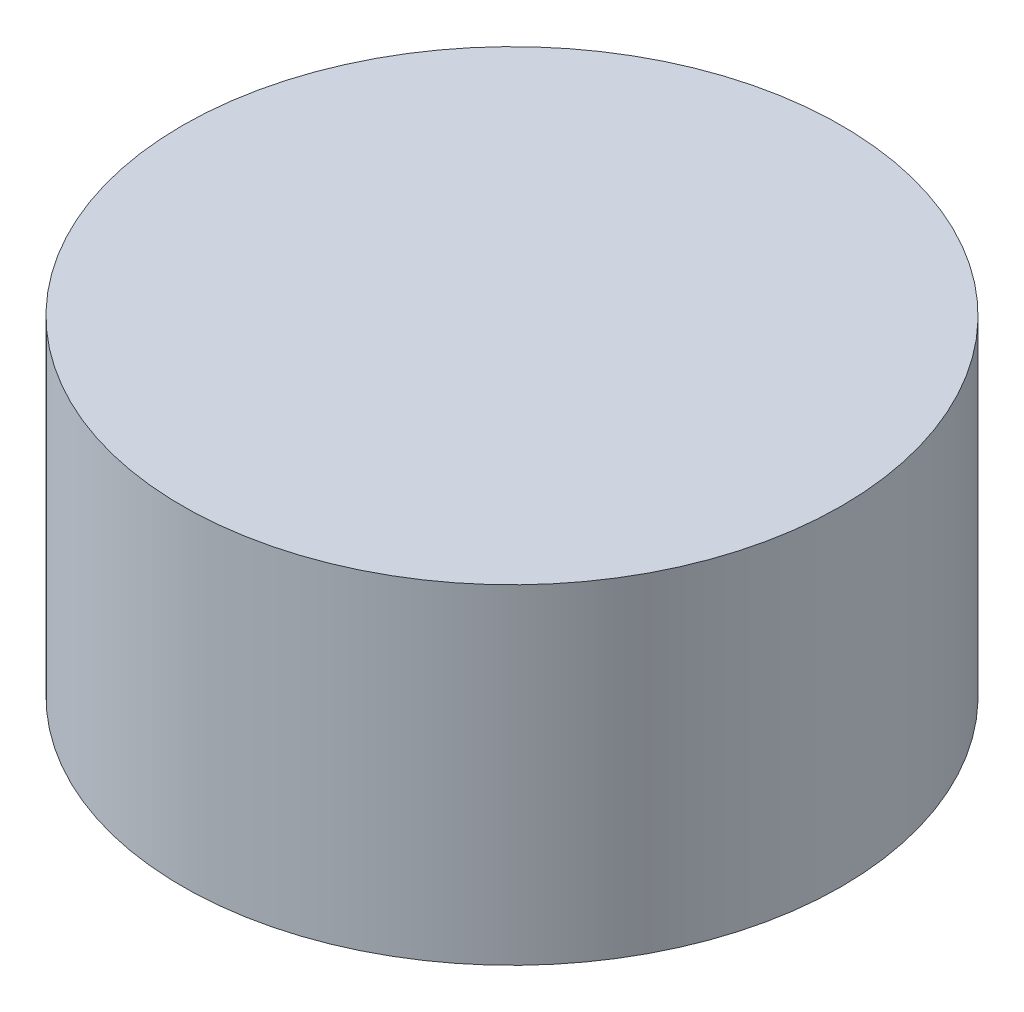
ISO-10303-21;
HEADER;
FILE_DESCRIPTION(('STEP AP214'),'2;1');
FILE_NAME('part.step','',(''),(''),'','','');
FILE_SCHEMA(('AUTOMOTIVE_DESIGN { 1 0 10303 214 1 1 1 1 }'));
ENDSEC;
DATA;
#1=APPLICATION_CONTEXT('core data for automotive mechanical design processes');
#2=APPLICATION_PROTOCOL_DEFINITION('international standard','automotive_design',2000,#1);
#3=PRODUCT_CONTEXT('',#1,'mechanical');
#4=PRODUCT('Part','Part','',(#3));
#5=PRODUCT_RELATED_PRODUCT_CATEGORY('part','',(#4));
#6=PRODUCT_DEFINITION_FORMATION('','',#4);
#7=PRODUCT_DEFINITION_CONTEXT('part definition',#1,'design');
#8=PRODUCT_DEFINITION('design','',#6,#7);
#9=PRODUCT_DEFINITION_SHAPE('','',#8);
#10=(LENGTH_UNIT() NAMED_UNIT(*) SI_UNIT(.MILLI.,.METRE.));
#11=(NAMED_UNIT(*) PLANE_ANGLE_UNIT() SI_UNIT($,.RADIAN.));
#12=(NAMED_UNIT(*) SI_UNIT($,.STERADIAN.) SOLID_ANGLE_UNIT());
#13=UNCERTAINTY_MEASURE_WITH_UNIT(LENGTH_MEASURE(1.E-05),#10,'distance_accuracy_value','');
#14=(GEOMETRIC_REPRESENTATION_CONTEXT(3) GLOBAL_UNCERTAINTY_ASSIGNED_CONTEXT((#13)) GLOBAL_UNIT_ASSIGNED_CONTEXT((#10,
#11,#12)) REPRESENTATION_CONTEXT('',''));
#15=CARTESIAN_POINT('',(0.,0.,0.));
#16=DIRECTION('',(0.,0.,1.));
#17=DIRECTION('',(1.,0.,0.));
#18=AXIS2_PLACEMENT_3D('',#15,#16,#17);
#19=CARTESIAN_POINT('',(0.,-15.,20.));
#20=DIRECTION('',(0.514495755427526,0.857492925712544,0.));
#21=DIRECTION('',(-0.857492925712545,0.514495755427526,0.));
#22=AXIS2_PLACEMENT_3D('',#19,#20,#21);
#23=PLANE('',#22);
#24=DIRECTION('',(0.857492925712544,-0.514495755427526,0.));
#25=VECTOR('',#24,1.);
#26=CARTESIAN_POINT('',(0.,-15.,-20.));
#27=LINE('',#26,#25);
#28=CARTESIAN_POINT('',(-25.,0.,-20.));
#29=VERTEX_POINT('',#28);
#30=CARTESIAN_POINT('',(-2.58377770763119,-13.4497333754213,-20.));
#31=VERTEX_POINT('',#30);
#32=EDGE_CURVE('E230',#29,#31,#27,.T.);
#33=ORIENTED_EDGE('',*,*,#32,.T.);
#34=DIRECTION('',(0.,0.,-1.));
#35=VECTOR('',#34,1.);
#36=CARTESIAN_POINT('',(-2.58377770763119,-13.4497333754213,20.));
#37=LINE('',#36,#35);
#38=CARTESIAN_POINT('',(-2.58377770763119,-13.4497333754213,-10.));
#39=VERTEX_POINT('',#38);
#40=EDGE_CURVE('E54',#31,#39,#37,.F.);
#41=ORIENTED_EDGE('',*,*,#40,.T.);
#42=DIRECTION('',(0.857492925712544,-0.514495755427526,0.));
#43=VECTOR('',#42,1.);
#44=CARTESIAN_POINT('',(0.,-15.,-10.));
#45=LINE('',#44,#43);
#46=CARTESIAN_POINT('',(-25.,0.,-10.));
#47=VERTEX_POINT('',#46);
#48=EDGE_CURVE('E272',#47,#39,#45,.T.);
#49=ORIENTED_EDGE('',*,*,#48,.F.);
#50=DIRECTION('',(0.,0.,-1.));
#51=VECTOR('',#50,1.);
#52=CARTESIAN_POINT('',(-25.,0.,20.));
#53=LINE('',#52,#51);
#54=EDGE_CURVE('E138',#47,#29,#53,.T.);
#55=ORIENTED_EDGE('',*,*,#54,.T.);
#56=EDGE_LOOP('',(#33,#41,#49,#55));
#57=FACE_BOUND('',#56,.T.);
#58=ADVANCED_FACE('F45',(#57),#23,.F.);
#59=CARTESIAN_POINT('',(0.,-15.,20.));
#60=DIRECTION('',(-0.517811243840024,0.855494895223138,0.));
#61=DIRECTION('',(-0.855494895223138,-0.517811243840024,0.));
#62=AXIS2_PLACEMENT_3D('',#59,#60,#61);
#63=PLANE('',#62);
#64=DIRECTION('',(0.855494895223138,0.517811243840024,0.));
#65=VECTOR('',#64,1.);
#66=CARTESIAN_POINT('',(0.,-15.,-10.));
#67=LINE('',#66,#65);
#68=CARTESIAN_POINT('',(2.57775728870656,-13.4397432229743,-10.));
#69=VERTEX_POINT('',#68);
#70=CARTESIAN_POINT('',(24.7820486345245,0.,-10.));
#71=VERTEX_POINT('',#70);
#72=EDGE_CURVE('E275',#69,#71,#67,.T.);
#73=ORIENTED_EDGE('',*,*,#72,.F.);
#74=DIRECTION('',(0.,0.,-1.));
#75=VECTOR('',#74,1.);
#76=CARTESIAN_POINT('',(2.57775728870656,-13.4397432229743,20.));
#77=LINE('',#76,#75);
#78=CARTESIAN_POINT('',(2.57775728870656,-13.4397432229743,-20.));
#79=VERTEX_POINT('',#78);
#80=EDGE_CURVE('E213',#69,#79,#77,.T.);
#81=ORIENTED_EDGE('',*,*,#80,.T.);
#82=DIRECTION('',(0.855494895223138,0.517811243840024,0.));
#83=VECTOR('',#82,1.);
#84=CARTESIAN_POINT('',(0.,-15.,-20.));
#85=LINE('',#84,#83);
#86=CARTESIAN_POINT('',(24.7820486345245,0.,-20.));
#87=VERTEX_POINT('',#86);
#88=EDGE_CURVE('E229',#79,#87,#85,.T.);
#89=ORIENTED_EDGE('',*,*,#88,.T.);
#90=DIRECTION('',(0.,0.,-1.));
#91=VECTOR('',#90,1.);
#92=CARTESIAN_POINT('',(24.7820486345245,0.,0.));
#93=LINE('',#92,#91);
#94=EDGE_CURVE('E186',#71,#87,#93,.T.);
#95=ORIENTED_EDGE('',*,*,#94,.F.);
#96=EDGE_LOOP('',(#73,#81,#89,#95));
#97=FACE_BOUND('',#96,.T.);
#98=ADVANCED_FACE('F297',(#97),#63,.F.);
#99=CARTESIAN_POINT('',(0.,50.,0.));
#100=DIRECTION('',(0.,1.,0.));
#101=DIRECTION('',(-1.,0.,0.));
#102=AXIS2_PLACEMENT_3D('',#99,#100,#101);
#103=PLANE('',#102);
#104=CARTESIAN_POINT('',(0.,50.,0.));
#105=DIRECTION('',(0.,-1.,0.));
#106=DIRECTION('',(1.,0.,0.));
#107=AXIS2_PLACEMENT_3D('',#104,#105,#106);
#108=CIRCLE('',#107,50.);
#109=CARTESIAN_POINT('',(50.,50.,0.));
#110=VERTEX_POINT('',#109);
#111=EDGE_CURVE('E177',#110,#110,#108,.T.);
#112=ORIENTED_EDGE('',*,*,#111,.F.);
#113=EDGE_LOOP('',(#112));
#114=FACE_BOUND('',#113,.T.);
#115=ADVANCED_FACE('F303',(#114),#103,.T.);
#116=CARTESIAN_POINT('',(0.,0.,0.));
#117=DIRECTION('',(0.,-1.,0.));
#118=DIRECTION('',(1.,0.,0.));
#119=AXIS2_PLACEMENT_3D('',#116,#117,#118);
#120=CYLINDRICAL_SURFACE('',#119,50.);
#121=ORIENTED_EDGE('',*,*,#111,.T.);
#122=EDGE_LOOP('',(#121));
#123=FACE_BOUND('',#122,.T.);
#124=CARTESIAN_POINT('',(0.,0.,0.));
#125=DIRECTION('',(0.,-1.,0.));
#126=DIRECTION('',(1.,0.,0.));
#127=AXIS2_PLACEMENT_3D('',#124,#125,#126);
#128=CIRCLE('',#127,50.);
#129=CARTESIAN_POINT('',(50.,0.,0.));
#130=VERTEX_POINT('',#129);
#131=EDGE_CURVE('E172',#130,#130,#128,.T.);
#132=ORIENTED_EDGE('',*,*,#131,.F.);
#133=EDGE_LOOP('',(#132));
#134=FACE_BOUND('',#133,.T.);
#135=ADVANCED_FACE('F312',(#123,#134),#120,.T.);
#136=CARTESIAN_POINT('',(0.,0.,0.));
#137=DIRECTION('',(0.,-1.,0.));
#138=DIRECTION('',(1.,0.,0.));
#139=AXIS2_PLACEMENT_3D('',#136,#137,#138);
#140=PLANE('',#139);
#141=CARTESIAN_POINT('',(24.7820486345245,0.,20.));
#142=VERTEX_POINT('',#141);
#143=CARTESIAN_POINT('',(24.7820486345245,0.,10.));
#144=VERTEX_POINT('',#143);
#145=EDGE_CURVE('E187',#142,#144,#93,.T.);
#146=ORIENTED_EDGE('',*,*,#145,.T.);
#147=EDGE_CURVE('E191',#144,#71,#93,.T.);
#148=ORIENTED_EDGE('',*,*,#147,.T.);
#149=ORIENTED_EDGE('',*,*,#94,.T.);
#150=DIRECTION('',(-1.,0.,0.));
#151=VECTOR('',#150,1.);
#152=CARTESIAN_POINT('',(0.,0.,-20.));
#153=LINE('',#152,#151);
#154=EDGE_CURVE('E194',#87,#29,#153,.T.);
#155=ORIENTED_EDGE('',*,*,#154,.T.);
#156=ORIENTED_EDGE('',*,*,#54,.F.);
#157=DIRECTION('',(0.,0.,1.));
#158=VECTOR('',#157,1.);
#159=CARTESIAN_POINT('',(-25.,0.,-10.));
#160=LINE('',#159,#158);
#161=CARTESIAN_POINT('',(-25.,0.,10.));
#162=VERTEX_POINT('',#161);
#163=EDGE_CURVE('E129',#47,#162,#160,.T.);
#164=ORIENTED_EDGE('',*,*,#163,.T.);
#165=CARTESIAN_POINT('',(-25.,0.,20.));
#166=VERTEX_POINT('',#165);
#167=EDGE_CURVE('E136',#166,#162,#53,.T.);
#168=ORIENTED_EDGE('',*,*,#167,.F.);
#169=DIRECTION('',(-1.,0.,0.));
#170=VECTOR('',#169,1.);
#171=CARTESIAN_POINT('',(0.,0.,20.));
#172=LINE('',#171,#170);
#173=EDGE_CURVE('E190',#142,#166,#172,.T.);
#174=ORIENTED_EDGE('',*,*,#173,.F.);
#175=EDGE_LOOP('',(#146,#148,#149,#155,#156,#164,#168,#174));
#176=FACE_BOUND('',#175,.T.);
#177=ORIENTED_EDGE('',*,*,#131,.T.);
#178=EDGE_LOOP('',(#177));
#179=FACE_BOUND('',#178,.T.);
#180=ADVANCED_FACE('F132',(#176,#179),#140,.T.);
#181=DIRECTION('',(0.857492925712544,-0.514495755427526,0.));
#182=VECTOR('',#181,1.);
#183=CARTESIAN_POINT('',(0.,-15.,10.));
#184=LINE('',#183,#182);
#185=CARTESIAN_POINT('',(-2.58377770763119,-13.4497333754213,10.));
#186=VERTEX_POINT('',#185);
#187=EDGE_CURVE('E150',#162,#186,#184,.T.);
#188=ORIENTED_EDGE('',*,*,#187,.T.);
#189=DIRECTION('',(0.,0.,-1.));
#190=VECTOR('',#189,1.);
#191=CARTESIAN_POINT('',(-2.58377770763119,-13.4497333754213,20.));
#192=LINE('',#191,#190);
#193=CARTESIAN_POINT('',(-2.58377770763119,-13.4497333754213,20.));
#194=VERTEX_POINT('',#193);
#195=EDGE_CURVE('E207',#186,#194,#192,.F.);
#196=ORIENTED_EDGE('',*,*,#195,.T.);
#197=DIRECTION('',(0.857492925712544,-0.514495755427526,0.));
#198=VECTOR('',#197,1.);
#199=CARTESIAN_POINT('',(0.,-15.,20.));
#200=LINE('',#199,#198);
#201=EDGE_CURVE('E170',#166,#194,#200,.T.);
#202=ORIENTED_EDGE('',*,*,#201,.F.);
#203=ORIENTED_EDGE('',*,*,#167,.T.);
#204=EDGE_LOOP('',(#188,#196,#202,#203));
#205=FACE_BOUND('',#204,.T.);
#206=ADVANCED_FACE('F168',(#205),#23,.F.);
#207=DIRECTION('',(0.855494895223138,0.517811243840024,0.));
#208=VECTOR('',#207,1.);
#209=CARTESIAN_POINT('',(0.,-15.,20.));
#210=LINE('',#209,#208);
#211=CARTESIAN_POINT('',(2.57775728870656,-13.4397432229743,20.));
#212=VERTEX_POINT('',#211);
#213=EDGE_CURVE('E179',#212,#142,#210,.T.);
#214=ORIENTED_EDGE('',*,*,#213,.F.);
#215=DIRECTION('',(0.,0.,-1.));
#216=VECTOR('',#215,1.);
#217=CARTESIAN_POINT('',(2.57775728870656,-13.4397432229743,20.));
#218=LINE('',#217,#216);
#219=CARTESIAN_POINT('',(2.57775728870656,-13.4397432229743,10.));
#220=VERTEX_POINT('',#219);
#221=EDGE_CURVE('E201',#212,#220,#218,.T.);
#222=ORIENTED_EDGE('',*,*,#221,.T.);
#223=DIRECTION('',(0.855494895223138,0.517811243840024,0.));
#224=VECTOR('',#223,1.);
#225=CARTESIAN_POINT('',(0.,-15.,10.));
#226=LINE('',#225,#224);
#227=EDGE_CURVE('E249',#220,#144,#226,.T.);
#228=ORIENTED_EDGE('',*,*,#227,.T.);
#229=ORIENTED_EDGE('',*,*,#145,.F.);
#230=EDGE_LOOP('',(#214,#222,#228,#229));
#231=FACE_BOUND('',#230,.T.);
#232=ADVANCED_FACE('F248',(#231),#63,.F.);
#233=CARTESIAN_POINT('',(0.,0.,20.));
#234=DIRECTION('',(0.,0.,1.));
#235=DIRECTION('',(1.,0.,0.));
#236=AXIS2_PLACEMENT_3D('',#233,#234,#235);
#237=PLANE('',#236);
#238=ORIENTED_EDGE('',*,*,#201,.T.);
#239=CARTESIAN_POINT('',(-0.011298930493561,-9.16226874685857,20.));
#240=DIRECTION('',(0.,0.,1.));
#241=DIRECTION('',(1.,0.,0.));
#242=AXIS2_PLACEMENT_3D('',#239,#240,#241);
#243=CIRCLE('',#242,5.);
#244=EDGE_CURVE('E210',#194,#212,#243,.T.);
#245=ORIENTED_EDGE('',*,*,#244,.T.);
#246=ORIENTED_EDGE('',*,*,#213,.T.);
#247=ORIENTED_EDGE('',*,*,#173,.T.);
#248=EDGE_LOOP('',(#238,#245,#246,#247));
#249=FACE_BOUND('',#248,.T.);
#250=ADVANCED_FACE('F245',(#249),#237,.T.);
#251=CARTESIAN_POINT('',(0.,0.,-20.));
#252=DIRECTION('',(0.,0.,1.));
#253=DIRECTION('',(1.,0.,0.));
#254=AXIS2_PLACEMENT_3D('',#251,#252,#253);
#255=PLANE('',#254);
#256=ORIENTED_EDGE('',*,*,#88,.F.);
#257=CARTESIAN_POINT('',(-0.011298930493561,-9.16226874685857,-20.));
#258=DIRECTION('',(0.,0.,1.));
#259=DIRECTION('',(1.,0.,0.));
#260=AXIS2_PLACEMENT_3D('',#257,#258,#259);
#261=CIRCLE('',#260,5.);
#262=EDGE_CURVE('E68',#79,#31,#261,.F.);
#263=ORIENTED_EDGE('',*,*,#262,.T.);
#264=ORIENTED_EDGE('',*,*,#32,.F.);
#265=ORIENTED_EDGE('',*,*,#154,.F.);
#266=EDGE_LOOP('',(#256,#263,#264,#265));
#267=FACE_BOUND('',#266,.T.);
#268=ADVANCED_FACE('F228',(#267),#255,.F.);
#269=CARTESIAN_POINT('',(-25.,15.1319209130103,-10.));
#270=DIRECTION('',(-1.,0.,0.));
#271=DIRECTION('',(0.,-1.,0.));
#272=AXIS2_PLACEMENT_3D('',#269,#270,#271);
#273=PLANE('',#272);
#274=DIRECTION('',(0.,0.,1.));
#275=VECTOR('',#274,1.);
#276=CARTESIAN_POINT('',(-25.,15.1319209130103,-10.));
#277=LINE('',#276,#275);
#278=CARTESIAN_POINT('',(-25.,15.1319209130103,-10.));
#279=VERTEX_POINT('',#278);
#280=CARTESIAN_POINT('',(-25.,15.1319209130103,10.));
#281=VERTEX_POINT('',#280);
#282=EDGE_CURVE('E162',#279,#281,#277,.T.);
#283=ORIENTED_EDGE('',*,*,#282,.T.);
#284=DIRECTION('',(0.,-1.,0.));
#285=VECTOR('',#284,1.);
#286=CARTESIAN_POINT('',(-25.,15.1319209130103,10.));
#287=LINE('',#286,#285);
#288=EDGE_CURVE('E154',#281,#162,#287,.T.);
#289=ORIENTED_EDGE('',*,*,#288,.T.);
#290=ORIENTED_EDGE('',*,*,#163,.F.);
#291=DIRECTION('',(0.,-1.,0.));
#292=VECTOR('',#291,1.);
#293=CARTESIAN_POINT('',(-25.,15.1319209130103,-10.));
#294=LINE('',#293,#292);
#295=EDGE_CURVE('E269',#279,#47,#294,.T.);
#296=ORIENTED_EDGE('',*,*,#295,.F.);
#297=EDGE_LOOP('',(#283,#289,#290,#296));
#298=FACE_BOUND('',#297,.T.);
#299=ADVANCED_FACE('F161',(#298),#273,.F.);
#300=CARTESIAN_POINT('',(-25.,15.1319209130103,-10.));
#301=DIRECTION('',(0.,1.,0.));
#302=DIRECTION('',(-1.,0.,0.));
#303=AXIS2_PLACEMENT_3D('',#300,#301,#302);
#304=PLANE('',#303);
#305=DIRECTION('',(0.,0.,1.));
#306=VECTOR('',#305,1.);
#307=CARTESIAN_POINT('',(25.,15.1319209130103,-10.));
#308=LINE('',#307,#306);
#309=CARTESIAN_POINT('',(25.,15.1319209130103,-10.));
#310=VERTEX_POINT('',#309);
#311=CARTESIAN_POINT('',(25.,15.1319209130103,10.));
#312=VERTEX_POINT('',#311);
#313=EDGE_CURVE('E236',#310,#312,#308,.T.);
#314=ORIENTED_EDGE('',*,*,#313,.T.);
#315=DIRECTION('',(-1.,0.,0.));
#316=VECTOR('',#315,1.);
#317=CARTESIAN_POINT('',(-25.,15.1319209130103,10.));
#318=LINE('',#317,#316);
#319=EDGE_CURVE('E266',#312,#281,#318,.T.);
#320=ORIENTED_EDGE('',*,*,#319,.T.);
#321=ORIENTED_EDGE('',*,*,#282,.F.);
#322=DIRECTION('',(-1.,0.,0.));
#323=VECTOR('',#322,1.);
#324=CARTESIAN_POINT('',(-25.,15.1319209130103,-10.));
#325=LINE('',#324,#323);
#326=EDGE_CURVE('E145',#310,#279,#325,.T.);
#327=ORIENTED_EDGE('',*,*,#326,.F.);
#328=EDGE_LOOP('',(#314,#320,#321,#327));
#329=FACE_BOUND('',#328,.T.);
#330=ADVANCED_FACE('F294',(#329),#304,.F.);
#331=CARTESIAN_POINT('',(25.,15.1319209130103,-10.));
#332=DIRECTION('',(1.,0.,0.));
#333=DIRECTION('',(0.,0.,-1.));
#334=AXIS2_PLACEMENT_3D('',#331,#332,#333);
#335=PLANE('',#334);
#336=DIRECTION('',(0.,0.,1.));
#337=VECTOR('',#336,1.);
#338=CARTESIAN_POINT('',(25.,0.131920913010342,-10.));
#339=LINE('',#338,#337);
#340=CARTESIAN_POINT('',(25.,0.131920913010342,-10.));
#341=VERTEX_POINT('',#340);
#342=CARTESIAN_POINT('',(25.,0.131920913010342,10.));
#343=VERTEX_POINT('',#342);
#344=EDGE_CURVE('E144',#341,#343,#339,.T.);
#345=ORIENTED_EDGE('',*,*,#344,.T.);
#346=DIRECTION('',(0.,1.,0.));
#347=VECTOR('',#346,1.);
#348=CARTESIAN_POINT('',(25.,15.1319209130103,10.));
#349=LINE('',#348,#347);
#350=EDGE_CURVE('E252',#343,#312,#349,.T.);
#351=ORIENTED_EDGE('',*,*,#350,.T.);
#352=ORIENTED_EDGE('',*,*,#313,.F.);
#353=DIRECTION('',(0.,1.,0.));
#354=VECTOR('',#353,1.);
#355=CARTESIAN_POINT('',(25.,15.1319209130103,-10.));
#356=LINE('',#355,#354);
#357=EDGE_CURVE('E278',#341,#310,#356,.T.);
#358=ORIENTED_EDGE('',*,*,#357,.F.);
#359=EDGE_LOOP('',(#345,#351,#352,#358));
#360=FACE_BOUND('',#359,.T.);
#361=ADVANCED_FACE('F289',(#360),#335,.F.);
#362=CARTESIAN_POINT('',(0.,-15.,-10.));
#363=DIRECTION('',(0.517811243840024,-0.855494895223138,0.));
#364=DIRECTION('',(0.855494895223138,0.517811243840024,0.));
#365=AXIS2_PLACEMENT_3D('',#362,#363,#364);
#366=PLANE('',#365);
#367=ORIENTED_EDGE('',*,*,#147,.F.);
#368=EDGE_CURVE('E159',#144,#343,#226,.T.);
#369=ORIENTED_EDGE('',*,*,#368,.T.);
#370=ORIENTED_EDGE('',*,*,#344,.F.);
#371=EDGE_CURVE('E260',#71,#341,#67,.T.);
#372=ORIENTED_EDGE('',*,*,#371,.F.);
#373=EDGE_LOOP('',(#367,#369,#370,#372));
#374=FACE_BOUND('',#373,.T.);
#375=ADVANCED_FACE('F257',(#374),#366,.F.);
#376=CARTESIAN_POINT('',(0.,0.,-10.));
#377=DIRECTION('',(0.,0.,1.));
#378=DIRECTION('',(1.,0.,0.));
#379=AXIS2_PLACEMENT_3D('',#376,#377,#378);
#380=PLANE('',#379);
#381=CARTESIAN_POINT('',(0.,-5.,-10.));
#382=DIRECTION('',(0.,0.,1.));
#383=DIRECTION('',(1.,0.,0.));
#384=AXIS2_PLACEMENT_3D('',#381,#382,#383);
#385=CIRCLE('',#384,5.);
#386=CARTESIAN_POINT('',(5.,-5.,-10.));
#387=VERTEX_POINT('',#386);
#388=EDGE_CURVE('E197',#387,#387,#385,.T.);
#389=ORIENTED_EDGE('',*,*,#388,.F.);
#390=EDGE_LOOP('',(#389));
#391=FACE_BOUND('',#390,.T.);
#392=ORIENTED_EDGE('',*,*,#48,.T.);
#393=CARTESIAN_POINT('',(-0.011298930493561,-9.16226874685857,-10.));
#394=DIRECTION('',(0.,0.,1.));
#395=DIRECTION('',(1.,0.,0.));
#396=AXIS2_PLACEMENT_3D('',#393,#394,#395);
#397=CIRCLE('',#396,5.);
#398=EDGE_CURVE('E11',#39,#69,#397,.T.);
#399=ORIENTED_EDGE('',*,*,#398,.T.);
#400=ORIENTED_EDGE('',*,*,#72,.T.);
#401=ORIENTED_EDGE('',*,*,#371,.T.);
#402=ORIENTED_EDGE('',*,*,#357,.T.);
#403=ORIENTED_EDGE('',*,*,#326,.T.);
#404=ORIENTED_EDGE('',*,*,#295,.T.);
#405=EDGE_LOOP('',(#392,#399,#400,#401,#402,#403,#404));
#406=FACE_BOUND('',#405,.T.);
#407=ADVANCED_FACE('F292',(#391,#406),#380,.T.);
#408=CARTESIAN_POINT('',(0.,0.,10.));
#409=DIRECTION('',(0.,0.,1.));
#410=DIRECTION('',(1.,0.,0.));
#411=AXIS2_PLACEMENT_3D('',#408,#409,#410);
#412=PLANE('',#411);
#413=CARTESIAN_POINT('',(0.,-5.,10.));
#414=DIRECTION('',(0.,0.,1.));
#415=DIRECTION('',(1.,0.,0.));
#416=AXIS2_PLACEMENT_3D('',#413,#414,#415);
#417=CIRCLE('',#416,5.);
#418=CARTESIAN_POINT('',(5.,-5.,10.));
#419=VERTEX_POINT('',#418);
#420=EDGE_CURVE('E165',#419,#419,#417,.T.);
#421=ORIENTED_EDGE('',*,*,#420,.T.);
#422=EDGE_LOOP('',(#421));
#423=FACE_BOUND('',#422,.T.);
#424=ORIENTED_EDGE('',*,*,#227,.F.);
#425=CARTESIAN_POINT('',(-0.011298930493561,-9.16226874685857,10.));
#426=DIRECTION('',(0.,0.,1.));
#427=DIRECTION('',(1.,0.,0.));
#428=AXIS2_PLACEMENT_3D('',#425,#426,#427);
#429=CIRCLE('',#428,5.);
#430=EDGE_CURVE('E155',#220,#186,#429,.F.);
#431=ORIENTED_EDGE('',*,*,#430,.T.);
#432=ORIENTED_EDGE('',*,*,#187,.F.);
#433=ORIENTED_EDGE('',*,*,#288,.F.);
#434=ORIENTED_EDGE('',*,*,#319,.F.);
#435=ORIENTED_EDGE('',*,*,#350,.F.);
#436=ORIENTED_EDGE('',*,*,#368,.F.);
#437=EDGE_LOOP('',(#424,#431,#432,#433,#434,#435,#436));
#438=FACE_BOUND('',#437,.T.);
#439=ADVANCED_FACE('F152',(#423,#438),#412,.F.);
#440=CARTESIAN_POINT('',(0.,-5.,-10.));
#441=DIRECTION('',(0.,0.,1.));
#442=DIRECTION('',(1.,0.,0.));
#443=AXIS2_PLACEMENT_3D('',#440,#441,#442);
#444=CYLINDRICAL_SURFACE('',#443,5.);
#445=ORIENTED_EDGE('',*,*,#388,.T.);
#446=EDGE_LOOP('',(#445));
#447=FACE_BOUND('',#446,.T.);
#448=ORIENTED_EDGE('',*,*,#420,.F.);
#449=EDGE_LOOP('',(#448));
#450=FACE_BOUND('',#449,.T.);
#451=ADVANCED_FACE('F323',(#447,#450),#444,.T.);
#452=CARTESIAN_POINT('',(-0.011298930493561,-9.16226874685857,20.));
#453=DIRECTION('',(0.,0.,-1.));
#454=DIRECTION('',(-1.,0.,0.));
#455=AXIS2_PLACEMENT_3D('',#452,#453,#454);
#456=CYLINDRICAL_SURFACE('',#455,5.);
#457=ORIENTED_EDGE('',*,*,#244,.F.);
#458=ORIENTED_EDGE('',*,*,#195,.F.);
#459=ORIENTED_EDGE('',*,*,#430,.F.);
#460=ORIENTED_EDGE('',*,*,#221,.F.);
#461=EDGE_LOOP('',(#457,#458,#459,#460));
#462=FACE_BOUND('',#461,.T.);
#463=ADVANCED_FACE('F322',(#462),#456,.T.);
#464=CARTESIAN_POINT('',(-0.011298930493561,-9.16226874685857,20.));
#465=DIRECTION('',(0.,0.,-1.));
#466=DIRECTION('',(-1.,0.,0.));
#467=AXIS2_PLACEMENT_3D('',#464,#465,#466);
#468=CYLINDRICAL_SURFACE('',#467,5.);
#469=ORIENTED_EDGE('',*,*,#398,.F.);
#470=ORIENTED_EDGE('',*,*,#40,.F.);
#471=ORIENTED_EDGE('',*,*,#262,.F.);
#472=ORIENTED_EDGE('',*,*,#80,.F.);
#473=EDGE_LOOP('',(#469,#470,#471,#472));
#474=FACE_BOUND('',#473,.T.);
#475=ADVANCED_FACE('F47',(#474),#468,.T.);
#476=CLOSED_SHELL('',(#58,#98,#115,#135,#180,#206,#232,#250,#268,#299,#330,#361,#375,#407,#439,
#451,#463,#475));
#477=MANIFOLD_SOLID_BREP('B2',#476);
#478=ADVANCED_BREP_SHAPE_REPRESENTATION('',(#18,#477),#14);
#479=SHAPE_DEFINITION_REPRESENTATION(#9,#478);
ENDSEC;
END-ISO-10303-21;
